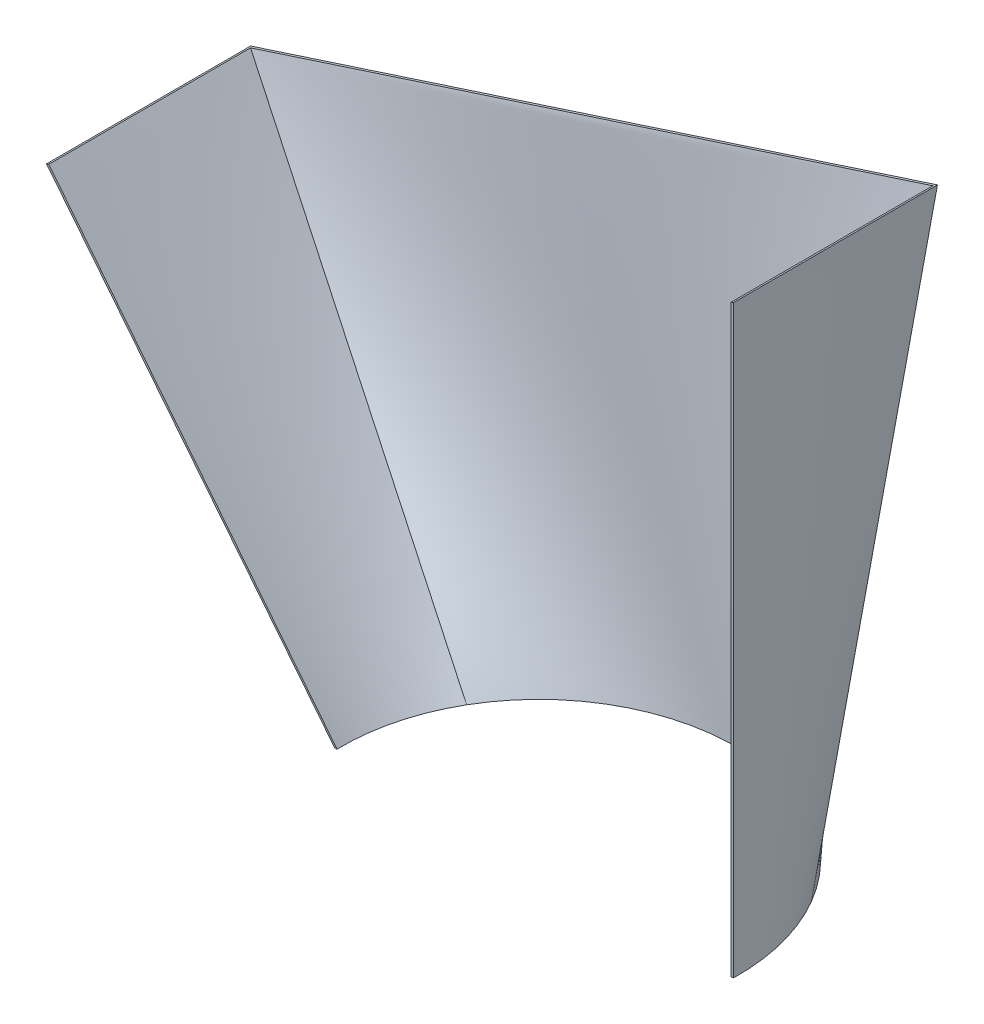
ISO-10303-21;
HEADER;
FILE_DESCRIPTION(('STEP AP214'),'2;1');
FILE_NAME('part.step','',(''),(''),'','','');
FILE_SCHEMA(('AUTOMOTIVE_DESIGN { 1 0 10303 214 1 1 1 1 }'));
ENDSEC;
DATA;
#1=APPLICATION_CONTEXT('core data for automotive mechanical design processes');
#2=APPLICATION_PROTOCOL_DEFINITION('international standard','automotive_design',2000,#1);
#3=PRODUCT_CONTEXT('',#1,'mechanical');
#4=PRODUCT('Part','Part','',(#3));
#5=PRODUCT_RELATED_PRODUCT_CATEGORY('part','',(#4));
#6=PRODUCT_DEFINITION_FORMATION('','',#4);
#7=PRODUCT_DEFINITION_CONTEXT('part definition',#1,'design');
#8=PRODUCT_DEFINITION('design','',#6,#7);
#9=PRODUCT_DEFINITION_SHAPE('','',#8);
#10=(LENGTH_UNIT() NAMED_UNIT(*) SI_UNIT(.MILLI.,.METRE.));
#11=(NAMED_UNIT(*) PLANE_ANGLE_UNIT() SI_UNIT($,.RADIAN.));
#12=(NAMED_UNIT(*) SI_UNIT($,.STERADIAN.) SOLID_ANGLE_UNIT());
#13=UNCERTAINTY_MEASURE_WITH_UNIT(LENGTH_MEASURE(1.E-05),#10,'distance_accuracy_value','');
#14=(GEOMETRIC_REPRESENTATION_CONTEXT(3) GLOBAL_UNCERTAINTY_ASSIGNED_CONTEXT((#13)) GLOBAL_UNIT_ASSIGNED_CONTEXT((#10,
#11,#12)) REPRESENTATION_CONTEXT('',''));
#15=CARTESIAN_POINT('',(0.,0.,0.));
#16=DIRECTION('',(0.,0.,1.));
#17=DIRECTION('',(1.,0.,0.));
#18=AXIS2_PLACEMENT_3D('',#15,#16,#17);
#19=CARTESIAN_POINT('',(0.,0.,0.));
#20=DIRECTION('',(0.,1.,0.));
#21=DIRECTION('',(0.,0.,1.));
#22=AXIS2_PLACEMENT_3D('',#19,#20,#21);
#23=PLANE('',#22);
#24=DIRECTION('',(1.,0.,0.));
#25=VECTOR('',#24,1.);
#26=CARTESIAN_POINT('',(0.,0.,10.));
#27=LINE('',#26,#25);
#28=CARTESIAN_POINT('',(-420.881215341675,0.,10.0000012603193));
#29=VERTEX_POINT('',#28);
#30=CARTESIAN_POINT('',(-415.879763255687,0.,10.0000006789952));
#31=VERTEX_POINT('',#30);
#32=EDGE_CURVE('E112',#29,#31,#27,.T.);
#33=ORIENTED_EDGE('',*,*,#32,.F.);
#34=CARTESIAN_POINT('',(0.,0.,0.));
#35=DIRECTION('',(0.,1.,0.));
#36=DIRECTION('',(0.,0.,1.));
#37=AXIS2_PLACEMENT_3D('',#34,#35,#36);
#38=CIRCLE('',#37,421.);
#39=CARTESIAN_POINT('',(-364.091974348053,0.,-211.371791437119));
#40=VERTEX_POINT('',#39);
#41=EDGE_CURVE('E263',#40,#29,#38,.T.);
#42=ORIENTED_EDGE('',*,*,#41,.F.);
#43=CARTESIAN_POINT('',(364.091974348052,0.,-211.371791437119));
#44=VERTEX_POINT('',#43);
#45=EDGE_CURVE('E268',#44,#40,#38,.T.);
#46=ORIENTED_EDGE('',*,*,#45,.F.);
#47=CARTESIAN_POINT('',(420.881217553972,0.,10.0000013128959));
#48=VERTEX_POINT('',#47);
#49=EDGE_CURVE('E276',#48,#44,#38,.T.);
#50=ORIENTED_EDGE('',*,*,#49,.F.);
#51=CARTESIAN_POINT('',(415.879789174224,0.,10.0000013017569));
#52=VERTEX_POINT('',#51);
#53=EDGE_CURVE('E344',#52,#48,#27,.T.);
#54=ORIENTED_EDGE('',*,*,#53,.F.);
#55=CARTESIAN_POINT('',(0.,0.,0.));
#56=DIRECTION('',(0.,1.,0.));
#57=DIRECTION('',(0.,0.,1.));
#58=AXIS2_PLACEMENT_3D('',#55,#56,#57);
#59=CIRCLE('',#58,416.);
#60=CARTESIAN_POINT('',(360.253087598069,0.,-208.023346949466));
#61=VERTEX_POINT('',#60);
#62=EDGE_CURVE('E239',#52,#61,#59,.T.);
#63=ORIENTED_EDGE('',*,*,#62,.T.);
#64=CARTESIAN_POINT('',(-360.253087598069,0.,-208.023346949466));
#65=VERTEX_POINT('',#64);
#66=EDGE_CURVE('E310',#61,#65,#59,.T.);
#67=ORIENTED_EDGE('',*,*,#66,.T.);
#68=EDGE_CURVE('E294',#65,#31,#59,.T.);
#69=ORIENTED_EDGE('',*,*,#68,.T.);
#70=EDGE_LOOP('',(#33,#42,#46,#50,#54,#63,#67,#69));
#71=FACE_BOUND('',#70,.T.);
#72=ADVANCED_FACE('F87',(#71),#23,.F.);
#73=CARTESIAN_POINT('',(420.999999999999,1235.,-421.));
#74=DIRECTION('',(-0.309016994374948,0.951056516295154,0.));
#75=DIRECTION('',(-0.951056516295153,-0.309016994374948,0.));
#76=AXIS2_PLACEMENT_3D('',#73,#74,#75);
#77=PLANE('',#76);
#78=DIRECTION('',(0.,0.,-1.));
#79=VECTOR('',#78,1.);
#80=CARTESIAN_POINT('',(-1029.36118735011,763.749083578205,421.));
#81=LINE('',#80,#79);
#82=CARTESIAN_POINT('',(-1029.36118735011,763.749083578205,10.));
#83=VERTEX_POINT('',#82);
#84=CARTESIAN_POINT('',(-1029.36118735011,763.749083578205,-421.));
#85=VERTEX_POINT('',#84);
#86=EDGE_CURVE('E97',#83,#85,#81,.T.);
#87=ORIENTED_EDGE('',*,*,#86,.F.);
#88=DIRECTION('',(0.951056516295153,0.309016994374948,0.));
#89=VECTOR('',#88,1.);
#90=CARTESIAN_POINT('',(420.999999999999,1235.,10.));
#91=LINE('',#90,#89);
#92=CARTESIAN_POINT('',(-1024.60590476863,765.294168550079,9.99999999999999));
#93=VERTEX_POINT('',#92);
#94=EDGE_CURVE('E153',#83,#93,#91,.T.);
#95=ORIENTED_EDGE('',*,*,#94,.T.);
#96=DIRECTION('',(0.,0.,1.));
#97=VECTOR('',#96,1.);
#98=CARTESIAN_POINT('',(-1024.60590476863,765.294168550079,-416.));
#99=LINE('',#98,#97);
#100=CARTESIAN_POINT('',(-1024.60590476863,765.294168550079,-416.));
#101=VERTEX_POINT('',#100);
#102=EDGE_CURVE('E164',#101,#93,#99,.T.);
#103=ORIENTED_EDGE('',*,*,#102,.F.);
#104=DIRECTION('',(-0.951056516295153,-0.309016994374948,0.));
#105=VECTOR('',#104,1.);
#106=CARTESIAN_POINT('',(416.244717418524,1233.45491502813,-416.));
#107=LINE('',#106,#105);
#108=CARTESIAN_POINT('',(416.244717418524,1233.45491502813,-416.));
#109=VERTEX_POINT('',#108);
#110=EDGE_CURVE('E174',#109,#101,#107,.T.);
#111=ORIENTED_EDGE('',*,*,#110,.F.);
#112=DIRECTION('',(0.,0.,1.));
#113=VECTOR('',#112,1.);
#114=CARTESIAN_POINT('',(416.244717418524,1233.45491502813,-416.));
#115=LINE('',#114,#113);
#116=CARTESIAN_POINT('',(416.244717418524,1233.45491502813,9.99999999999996));
#117=VERTEX_POINT('',#116);
#118=EDGE_CURVE('E173',#109,#117,#115,.T.);
#119=ORIENTED_EDGE('',*,*,#118,.T.);
#120=CARTESIAN_POINT('',(420.999999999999,1235.,10.));
#121=VERTEX_POINT('',#120);
#122=EDGE_CURVE('E105',#117,#121,#91,.T.);
#123=ORIENTED_EDGE('',*,*,#122,.T.);
#124=DIRECTION('',(0.,0.,-1.));
#125=VECTOR('',#124,1.);
#126=CARTESIAN_POINT('',(420.999999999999,1235.,421.));
#127=LINE('',#126,#125);
#128=CARTESIAN_POINT('',(420.999999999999,1235.,-421.));
#129=VERTEX_POINT('',#128);
#130=EDGE_CURVE('E91',#121,#129,#127,.T.);
#131=ORIENTED_EDGE('',*,*,#130,.T.);
#132=DIRECTION('',(-0.951056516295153,-0.309016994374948,0.));
#133=VECTOR('',#132,1.);
#134=CARTESIAN_POINT('',(420.999999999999,1235.,-421.));
#135=LINE('',#134,#133);
#136=EDGE_CURVE('E251',#129,#85,#135,.T.);
#137=ORIENTED_EDGE('',*,*,#136,.T.);
#138=EDGE_LOOP('',(#87,#95,#103,#111,#119,#123,#131,#137));
#139=FACE_BOUND('',#138,.T.);
#140=ADVANCED_FACE('F162',(#139),#77,.T.);
#141=CARTESIAN_POINT('',(-1029.36118735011,763.749083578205,421.));
#142=CARTESIAN_POINT('',(-364.091974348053,0.,211.371791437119));
#143=CARTESIAN_POINT('',(-1029.36118735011,763.749083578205,385.916666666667));
#144=CARTESIAN_POINT('',(-372.935607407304,0.,196.138463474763));
#145=CARTESIAN_POINT('',(-1029.36118735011,763.749083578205,350.833333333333));
#146=CARTESIAN_POINT('',(-380.970778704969,0.,180.088104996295));
#147=CARTESIAN_POINT('',(-1029.36118735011,763.749083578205,298.208333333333));
#148=CARTESIAN_POINT('',(-391.535403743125,0.,154.994814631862));
#149=CARTESIAN_POINT('',(-1029.36118735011,763.749083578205,280.666666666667));
#150=CARTESIAN_POINT('',(-394.809273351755,0.,146.461634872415));
#151=CARTESIAN_POINT('',(-1029.36118735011,763.749083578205,245.583333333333));
#152=CARTESIAN_POINT('',(-400.821587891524,0.,129.10239151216));
#153=CARTESIAN_POINT('',(-1029.36118735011,763.749083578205,228.041666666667));
#154=CARTESIAN_POINT('',(-403.559995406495,0.,120.276351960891));
#155=CARTESIAN_POINT('',(-1029.36118735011,763.749083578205,192.958333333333));
#156=CARTESIAN_POINT('',(-408.466640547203,0.,102.382001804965));
#157=CARTESIAN_POINT('',(-1029.36118735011,763.749083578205,175.416666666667));
#158=CARTESIAN_POINT('',(-410.634845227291,0.,93.3137230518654));
#159=CARTESIAN_POINT('',(-1029.36118735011,763.749083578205,140.333333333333));
#160=CARTESIAN_POINT('',(-414.372817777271,0.,74.9906321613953));
#161=CARTESIAN_POINT('',(-1029.36118735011,763.749083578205,122.791666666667));
#162=CARTESIAN_POINT('',(-415.942559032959,0.,65.7358586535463));
#163=CARTESIAN_POINT('',(-1029.36118735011,763.749083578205,87.7083333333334));
#164=CARTESIAN_POINT('',(-418.462716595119,0.,47.0995790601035));
#165=CARTESIAN_POINT('',(-1029.36118735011,763.749083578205,70.1666666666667));
#166=CARTESIAN_POINT('',(-419.413114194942,0.,37.7181168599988));
#167=CARTESIAN_POINT('',(-1029.36118735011,763.749083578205,35.0833333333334));
#168=CARTESIAN_POINT('',(-420.681760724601,0.,18.8910796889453));
#169=CARTESIAN_POINT('',(-1029.36118735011,763.749083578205,17.5416666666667));
#170=CARTESIAN_POINT('',(-421.,0.,9.4455519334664));
#171=CARTESIAN_POINT('',(-1029.36118735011,763.749083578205,-17.5416666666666));
#172=CARTESIAN_POINT('',(-421.,0.,-9.44555193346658));
#173=CARTESIAN_POINT('',(-1029.36118735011,763.749083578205,-35.0833333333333));
#174=CARTESIAN_POINT('',(-420.681760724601,0.,-18.8910796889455));
#175=CARTESIAN_POINT('',(-1029.36118735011,763.749083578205,-70.1666666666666));
#176=CARTESIAN_POINT('',(-419.413114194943,0.,-37.718116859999));
#177=CARTESIAN_POINT('',(-1029.36118735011,763.749083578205,-87.7083333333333));
#178=CARTESIAN_POINT('',(-418.462716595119,0.,-47.0995790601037));
#179=CARTESIAN_POINT('',(-1029.36118735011,763.749083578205,-122.791666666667));
#180=CARTESIAN_POINT('',(-415.942559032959,0.,-65.7358586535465));
#181=CARTESIAN_POINT('',(-1029.36118735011,763.749083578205,-140.333333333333));
#182=CARTESIAN_POINT('',(-414.372817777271,0.,-74.9906321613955));
#183=CARTESIAN_POINT('',(-1029.36118735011,763.749083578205,-175.416666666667));
#184=CARTESIAN_POINT('',(-410.634845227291,0.,-93.3137230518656));
#185=CARTESIAN_POINT('',(-1029.36118735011,763.749083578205,-192.958333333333));
#186=CARTESIAN_POINT('',(-408.466640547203,0.,-102.382001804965));
#187=CARTESIAN_POINT('',(-1029.36118735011,763.749083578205,-228.041666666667));
#188=CARTESIAN_POINT('',(-403.559995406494,0.,-120.276351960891));
#189=CARTESIAN_POINT('',(-1029.36118735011,763.749083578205,-245.583333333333));
#190=CARTESIAN_POINT('',(-400.821587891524,0.,-129.10239151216));
#191=CARTESIAN_POINT('',(-1029.36118735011,763.749083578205,-280.666666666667));
#192=CARTESIAN_POINT('',(-394.809273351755,0.,-146.461634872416));
#193=CARTESIAN_POINT('',(-1029.36118735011,763.749083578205,-298.208333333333));
#194=CARTESIAN_POINT('',(-391.535403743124,0.,-154.994814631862));
#195=CARTESIAN_POINT('',(-1029.36118735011,763.749083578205,-350.833333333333));
#196=CARTESIAN_POINT('',(-380.970778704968,0.,-180.088104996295));
#197=CARTESIAN_POINT('',(-1029.36118735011,763.749083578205,-385.916666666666));
#198=CARTESIAN_POINT('',(-372.935607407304,0.,-196.138463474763));
#199=CARTESIAN_POINT('',(-1029.36118735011,763.749083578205,-421.));
#200=CARTESIAN_POINT('',(-364.091974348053,0.,-211.371791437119));
#201=B_SPLINE_SURFACE_WITH_KNOTS('',3,1,((#141,#142),(#143,#144),(#145,#146),(#147,#148),(#149,
#150),(#151,#152),(#153,#154),(#155,#156),(#157,#158),(#159,#160),(#161,#162),(#163,#164),(#165,
#166),(#167,#168),(#169,#170),(#171,#172),(#173,#174),(#175,#176),(#177,#178),(#179,#180),(#181,
#182),(#183,#184),(#185,#186),(#187,#188),(#189,#190),(#191,#192),(#193,#194),(#195,#196),(#197,
#198),(#199,#200)),.UNSPECIFIED.,.F.,.F.,.F.,(4,2,2,2,2,2,2,2,2,2,2,2,2,2,4),(2,2),(0.,0.125,
0.1875,0.25,0.3125,0.375,0.4375,0.5,0.5625,0.625,0.6875,0.75,0.8125,0.875,1.),(0.,1.),.UNSPECIFIED.);
#202=CARTESIAN_POINT('',(-420.881162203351,0.,9.99999999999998));
#203=CARTESIAN_POINT('',(-434.863254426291,17.5441170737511,9.99999999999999));
#204=CARTESIAN_POINT('',(-448.844911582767,35.0885808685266,10.));
#205=CARTESIAN_POINT('',(-476.807514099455,70.1780756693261,10.));
#206=CARTESIAN_POINT('',(-490.788459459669,87.7231066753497,10.));
#207=CARTESIAN_POINT('',(-532.730465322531,140.358861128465,10.));
#208=CARTESIAN_POINT('',(-560.690695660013,175.450246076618,10.));
#209=CARTESIAN_POINT('',(-616.609719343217,245.634160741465,10.));
#210=CARTESIAN_POINT('',(-644.568512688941,280.726690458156,10.));
#211=CARTESIAN_POINT('',(-700.485121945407,350.912528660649,10.));
#212=CARTESIAN_POINT('',(-728.442937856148,386.00583714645,10.));
#213=CARTESIAN_POINT('',(-801.895190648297,478.206647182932,10.));
#214=CARTESIAN_POINT('',(-847.389073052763,535.314590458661,10.));
#215=CARTESIAN_POINT('',(-915.629122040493,620.977122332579,10.));
#216=CARTESIAN_POINT('',(-938.375675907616,649.531402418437,10.));
#217=CARTESIAN_POINT('',(-983.868575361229,706.640128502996,10.));
#218=CARTESIAN_POINT('',(-1006.61492094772,735.194574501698,10.));
#219=CARTESIAN_POINT('',(-1029.36118735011,763.749083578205,10.));
#220=B_SPLINE_CURVE_WITH_KNOTS('',3,(#202,#203,#204,#205,#206,#207,#208,#209,#210,#211,#212,
#213,#214,#215,#216,#217,#218,#219),.UNSPECIFIED.,.F.,.F.,(4,2,2,2,2,2,2,2,4),(0.,
67.3027081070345,134.605416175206,269.210832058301,403.816247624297,538.421663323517,
757.462971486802,866.983625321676,976.50427914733),.UNSPECIFIED.);
#221=EDGE_CURVE('E350',#29,#83,#220,.T.);
#222=DIRECTION('',(0.643188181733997,-0.738399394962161,0.202670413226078));
#223=VECTOR('',#222,1.);
#224=CARTESIAN_POINT('',(-696.726580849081,381.874541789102,-316.185895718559));
#225=LINE('',#224,#223);
#226=EDGE_CURVE('E407',#85,#40,#225,.T.);
#227=ORIENTED_EDGE('',*,*,#41,.T.);
#228=ORIENTED_EDGE('',*,*,#221,.T.);
#229=ORIENTED_EDGE('',*,*,#86,.T.);
#230=ORIENTED_EDGE('',*,*,#226,.T.);
#231=EDGE_LOOP('',(#227,#228,#229,#230));
#232=FACE_BOUND('',#231,.T.);
#233=ADVANCED_FACE('F371',(#232),#201,.T.);
#234=CARTESIAN_POINT('',(420.999999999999,1235.,-421.));
#235=CARTESIAN_POINT('',(364.091974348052,0.,-211.371791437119));
#236=CARTESIAN_POINT('',(420.999999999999,1235.,-385.916666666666));
#237=CARTESIAN_POINT('',(372.935607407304,0.,-196.138463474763));
#238=CARTESIAN_POINT('',(420.999999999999,1235.,-350.833333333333));
#239=CARTESIAN_POINT('',(380.970778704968,0.,-180.088104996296));
#240=CARTESIAN_POINT('',(420.999999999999,1235.,-298.208333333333));
#241=CARTESIAN_POINT('',(391.535403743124,0.,-154.994814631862));
#242=CARTESIAN_POINT('',(420.999999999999,1235.,-280.666666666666));
#243=CARTESIAN_POINT('',(394.809273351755,0.,-146.461634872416));
#244=CARTESIAN_POINT('',(420.999999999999,1235.,-245.583333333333));
#245=CARTESIAN_POINT('',(400.821587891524,0.,-129.10239151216));
#246=CARTESIAN_POINT('',(420.999999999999,1235.,-228.041666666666));
#247=CARTESIAN_POINT('',(403.559995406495,0.,-120.276351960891));
#248=CARTESIAN_POINT('',(420.999999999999,1235.,-192.958333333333));
#249=CARTESIAN_POINT('',(408.466640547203,0.,-102.382001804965));
#250=CARTESIAN_POINT('',(420.999999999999,1235.,-175.416666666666));
#251=CARTESIAN_POINT('',(410.634845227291,0.,-93.3137230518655));
#252=CARTESIAN_POINT('',(420.999999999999,1235.,-140.333333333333));
#253=CARTESIAN_POINT('',(414.372817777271,0.,-74.9906321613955));
#254=CARTESIAN_POINT('',(420.999999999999,1235.,-122.791666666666));
#255=CARTESIAN_POINT('',(415.942559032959,0.,-65.7358586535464));
#256=CARTESIAN_POINT('',(420.999999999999,1235.,-87.7083333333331));
#257=CARTESIAN_POINT('',(418.462716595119,0.,-47.0995790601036));
#258=CARTESIAN_POINT('',(420.999999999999,1235.,-70.1666666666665));
#259=CARTESIAN_POINT('',(419.413114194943,0.,-37.7181168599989));
#260=CARTESIAN_POINT('',(420.999999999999,1235.,-35.0833333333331));
#261=CARTESIAN_POINT('',(420.681760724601,0.,-18.8910796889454));
#262=CARTESIAN_POINT('',(420.999999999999,1235.,-17.5416666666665));
#263=CARTESIAN_POINT('',(421.,0.,-9.44555193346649));
#264=CARTESIAN_POINT('',(420.999999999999,1235.,17.5416666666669));
#265=CARTESIAN_POINT('',(421.,0.,9.44555193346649));
#266=CARTESIAN_POINT('',(420.999999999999,1235.,35.0833333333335));
#267=CARTESIAN_POINT('',(420.681760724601,0.,18.8910796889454));
#268=CARTESIAN_POINT('',(420.999999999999,1235.,70.1666666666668));
#269=CARTESIAN_POINT('',(419.413114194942,0.,37.7181168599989));
#270=CARTESIAN_POINT('',(420.999999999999,1235.,87.7083333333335));
#271=CARTESIAN_POINT('',(418.462716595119,0.,47.0995790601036));
#272=CARTESIAN_POINT('',(420.999999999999,1235.,122.791666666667));
#273=CARTESIAN_POINT('',(415.942559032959,0.,65.7358586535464));
#274=CARTESIAN_POINT('',(420.999999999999,1235.,140.333333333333));
#275=CARTESIAN_POINT('',(414.372817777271,0.,74.9906321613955));
#276=CARTESIAN_POINT('',(420.999999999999,1235.,175.416666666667));
#277=CARTESIAN_POINT('',(410.634845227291,0.,93.3137230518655));
#278=CARTESIAN_POINT('',(420.999999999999,1235.,192.958333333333));
#279=CARTESIAN_POINT('',(408.466640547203,0.,102.382001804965));
#280=CARTESIAN_POINT('',(420.999999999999,1235.,228.041666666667));
#281=CARTESIAN_POINT('',(403.559995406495,0.,120.276351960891));
#282=CARTESIAN_POINT('',(420.999999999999,1235.,245.583333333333));
#283=CARTESIAN_POINT('',(400.821587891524,0.,129.10239151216));
#284=CARTESIAN_POINT('',(420.999999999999,1235.,280.666666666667));
#285=CARTESIAN_POINT('',(394.809273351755,0.,146.461634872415));
#286=CARTESIAN_POINT('',(420.999999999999,1235.,298.208333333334));
#287=CARTESIAN_POINT('',(391.535403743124,0.,154.994814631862));
#288=CARTESIAN_POINT('',(420.999999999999,1235.,350.833333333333));
#289=CARTESIAN_POINT('',(380.970778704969,0.,180.088104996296));
#290=CARTESIAN_POINT('',(420.999999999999,1235.,385.916666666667));
#291=CARTESIAN_POINT('',(372.935607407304,0.,196.138463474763));
#292=CARTESIAN_POINT('',(420.999999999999,1235.,421.));
#293=CARTESIAN_POINT('',(364.091974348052,0.,211.371791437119));
#294=B_SPLINE_SURFACE_WITH_KNOTS('',3,1,((#234,#235),(#236,#237),(#238,#239),(#240,#241),(#242,
#243),(#244,#245),(#246,#247),(#248,#249),(#250,#251),(#252,#253),(#254,#255),(#256,#257),(#258,
#259),(#260,#261),(#262,#263),(#264,#265),(#266,#267),(#268,#269),(#270,#271),(#272,#273),(#274,
#275),(#276,#277),(#278,#279),(#280,#281),(#282,#283),(#284,#285),(#286,#287),(#288,#289),(#290,
#291),(#292,#293)),.UNSPECIFIED.,.F.,.F.,.F.,(4,2,2,2,2,2,2,2,2,2,2,2,2,2,4),(2,2),(0.,0.125,
0.1875,0.25,0.3125,0.375,0.4375,0.5,0.5625,0.625,0.6875,0.75,0.8125,0.875,1.),(0.,1.),.UNSPECIFIED.);
#295=CARTESIAN_POINT('',(420.999999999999,1235.,10.));
#296=CARTESIAN_POINT('',(420.998069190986,1166.6784234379,10.));
#297=CARTESIAN_POINT('',(420.995892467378,1098.356846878,10.));
#298=CARTESIAN_POINT('',(420.990693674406,961.713693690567,9.99999999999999));
#299=CARTESIAN_POINT('',(420.987671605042,893.392117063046,9.99999999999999));
#300=CARTESIAN_POINT('',(420.980405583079,756.314661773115,9.99999999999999));
#301=CARTESIAN_POINT('',(420.97615398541,687.558783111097,10.));
#302=CARTESIAN_POINT('',(420.965811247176,550.04702597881,9.99999999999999));
#303=CARTESIAN_POINT('',(420.959720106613,481.291147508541,9.99999999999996));
#304=CARTESIAN_POINT('',(420.948394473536,378.15732980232,9.99999999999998));
#305=CARTESIAN_POINT('',(420.944254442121,343.779390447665,9.99999999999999));
#306=CARTESIAN_POINT('',(420.935029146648,275.023511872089,10.));
#307=CARTESIAN_POINT('',(420.929943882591,240.645572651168,10.));
#308=CARTESIAN_POINT('',(420.918561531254,171.889694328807,10.));
#309=CARTESIAN_POINT('',(420.91226444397,137.511755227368,10.));
#310=CARTESIAN_POINT('',(420.898040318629,68.7558773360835,10.));
#311=CARTESIAN_POINT('',(420.890113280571,34.3779385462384,10.));
#312=CARTESIAN_POINT('',(420.881162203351,0.,10.));
#313=B_SPLINE_CURVE_WITH_KNOTS('',3,(#295,#296,#297,#298,#299,#300,#301,#302,#303,#304,#305,
#306,#307,#308,#309,#310,#311,#312),.UNSPECIFIED.,.F.,.F.,(4,2,2,2,2,2,2,2,4),(0.,
204.964729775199,409.929459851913,616.197096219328,822.464732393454,925.598551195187,
1028.73236997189,1131.86618897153,1235.00000805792),.UNSPECIFIED.);
#314=EDGE_CURVE('E295',#121,#48,#313,.T.);
#315=DIRECTION('',(-0.0453827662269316,-0.984882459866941,0.16717339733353));
#316=VECTOR('',#315,1.);
#317=CARTESIAN_POINT('',(392.545987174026,617.5,-316.18589571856));
#318=LINE('',#317,#316);
#319=EDGE_CURVE('E492',#129,#44,#318,.T.);
#320=ORIENTED_EDGE('',*,*,#130,.F.);
#321=ORIENTED_EDGE('',*,*,#314,.T.);
#322=ORIENTED_EDGE('',*,*,#49,.T.);
#323=ORIENTED_EDGE('',*,*,#319,.F.);
#324=EDGE_LOOP('',(#320,#321,#322,#323));
#325=FACE_BOUND('',#324,.T.);
#326=ADVANCED_FACE('F366',(#325),#294,.T.);
#327=CARTESIAN_POINT('',(416.244717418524,1233.45491502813,-416.));
#328=CARTESIAN_POINT('',(360.253087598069,0.,-208.023346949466));
#329=CARTESIAN_POINT('',(416.244717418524,1233.45491502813,-381.333333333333));
#330=CARTESIAN_POINT('',(368.921699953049,0.,-193.011116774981));
#331=CARTESIAN_POINT('',(416.244717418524,1233.45491502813,-346.666666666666));
#332=CARTESIAN_POINT('',(376.795315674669,0.,-177.201090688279));
#333=CARTESIAN_POINT('',(416.244717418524,1233.45491502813,-277.333333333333));
#334=CARTESIAN_POINT('',(390.595450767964,0.,-144.257167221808));
#335=CARTESIAN_POINT('',(416.244717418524,1233.45491502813,-242.666666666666));
#336=CARTESIAN_POINT('',(396.52074717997,0.,-127.123764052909));
#337=CARTESIAN_POINT('',(416.244717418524,1233.45491502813,-190.666666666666));
#338=CARTESIAN_POINT('',(403.728412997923,0.,-100.710759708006));
#339=CARTESIAN_POINT('',(416.244717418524,1233.45491502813,-173.333333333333));
#340=CARTESIAN_POINT('',(405.851558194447,0.,-91.7883526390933));
#341=CARTESIAN_POINT('',(416.244717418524,1233.45491502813,-138.666666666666));
#342=CARTESIAN_POINT('',(409.511657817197,0.,-73.7617182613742));
#343=CARTESIAN_POINT('',(416.244717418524,1233.45491502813,-121.333333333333));
#344=CARTESIAN_POINT('',(411.048586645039,0.,-64.6575283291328));
#345=CARTESIAN_POINT('',(416.244717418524,1233.45491502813,-86.6666666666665));
#346=CARTESIAN_POINT('',(413.515987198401,0.,-46.3256395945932));
#347=CARTESIAN_POINT('',(416.244717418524,1233.45491502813,-69.3333333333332));
#348=CARTESIAN_POINT('',(414.446440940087,0.,-37.0979832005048));
#349=CARTESIAN_POINT('',(416.244717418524,1233.45491502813,-34.6666666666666));
#350=CARTESIAN_POINT('',(415.688451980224,0.,-18.5801952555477));
#351=CARTESIAN_POINT('',(416.244717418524,1233.45491502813,-17.3333333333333));
#352=CARTESIAN_POINT('',(416.,0.,-9.29010929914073));
#353=CARTESIAN_POINT('',(416.244717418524,1233.45491502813,17.3333333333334));
#354=CARTESIAN_POINT('',(416.,0.,9.29010929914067));
#355=CARTESIAN_POINT('',(416.244717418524,1233.45491502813,34.6666666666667));
#356=CARTESIAN_POINT('',(415.688451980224,0.,18.5801952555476));
#357=CARTESIAN_POINT('',(416.244717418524,1233.45491502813,69.3333333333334));
#358=CARTESIAN_POINT('',(414.446440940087,0.,37.0979832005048));
#359=CARTESIAN_POINT('',(416.244717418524,1233.45491502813,86.6666666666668));
#360=CARTESIAN_POINT('',(413.515987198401,0.,46.3256395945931));
#361=CARTESIAN_POINT('',(416.244717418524,1233.45491502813,121.333333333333));
#362=CARTESIAN_POINT('',(411.048586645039,0.,64.6575283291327));
#363=CARTESIAN_POINT('',(416.244717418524,1233.45491502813,138.666666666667));
#364=CARTESIAN_POINT('',(409.511657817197,0.,73.7617182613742));
#365=CARTESIAN_POINT('',(416.244717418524,1233.45491502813,173.333333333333));
#366=CARTESIAN_POINT('',(405.851558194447,0.,91.7883526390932));
#367=CARTESIAN_POINT('',(416.244717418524,1233.45491502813,190.666666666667));
#368=CARTESIAN_POINT('',(403.728412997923,0.,100.710759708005));
#369=CARTESIAN_POINT('',(416.244717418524,1233.45491502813,242.666666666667));
#370=CARTESIAN_POINT('',(396.52074717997,0.,127.123764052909));
#371=CARTESIAN_POINT('',(416.244717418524,1233.45491502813,277.333333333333));
#372=CARTESIAN_POINT('',(390.595450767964,0.,144.257167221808));
#373=CARTESIAN_POINT('',(416.244717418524,1233.45491502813,346.666666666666));
#374=CARTESIAN_POINT('',(376.795315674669,0.,177.201090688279));
#375=CARTESIAN_POINT('',(416.244717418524,1233.45491502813,381.333333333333));
#376=CARTESIAN_POINT('',(368.921699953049,0.,193.011116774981));
#377=CARTESIAN_POINT('',(416.244717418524,1233.45491502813,416.));
#378=CARTESIAN_POINT('',(360.253087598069,0.,208.023346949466));
#379=B_SPLINE_SURFACE_WITH_KNOTS('',3,1,((#327,#328),(#329,#330),(#331,#332),(#333,#334),(#335,
#336),(#337,#338),(#339,#340),(#341,#342),(#343,#344),(#345,#346),(#347,#348),(#349,#350),(#351,
#352),(#353,#354),(#355,#356),(#357,#358),(#359,#360),(#361,#362),(#363,#364),(#365,#366),(#367,
#368),(#369,#370),(#371,#372),(#373,#374),(#375,#376),(#377,#378)),.UNSPECIFIED.,.F.,.F.,.F.,(4,
2,2,2,2,2,2,2,2,2,2,2,4),(2,2),(0.,0.125,0.25,0.3125,0.375,0.4375,0.5,0.5625,0.625,0.6875,0.75,
0.875,1.),(0.,1.),.UNSPECIFIED.);
#380=CARTESIAN_POINT('',(416.244717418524,1233.45491502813,10.));
#381=CARTESIAN_POINT('',(416.229273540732,1165.35274097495,10.));
#382=CARTESIAN_POINT('',(416.213583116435,1097.25056697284,10.));
#383=CARTESIAN_POINT('',(416.18135228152,961.046219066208,10.));
#384=CARTESIAN_POINT('',(416.164811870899,892.944045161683,10.));
#385=CARTESIAN_POINT('',(416.130364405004,756.105047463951,10.));
#386=CARTESIAN_POINT('',(416.112446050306,687.368223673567,10.));
#387=CARTESIAN_POINT('',(416.074741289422,549.894576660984,10.));
#388=CARTESIAN_POINT('',(416.054954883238,481.157753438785,10.));
#389=CARTESIAN_POINT('',(416.023044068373,378.052519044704,10.));
#390=CARTESIAN_POINT('',(416.012035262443,343.684107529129,10.));
#391=CARTESIAN_POINT('',(415.989051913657,274.947284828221,10.));
#392=CARTESIAN_POINT('',(415.977077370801,240.57887364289,10.));
#393=CARTESIAN_POINT('',(415.951887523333,171.842051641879,10.));
#394=CARTESIAN_POINT('',(415.938672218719,137.473640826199,10.));
#395=CARTESIAN_POINT('',(415.910567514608,68.7368198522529,10.));
#396=CARTESIAN_POINT('',(415.895678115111,34.3684096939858,9.99999999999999));
#397=CARTESIAN_POINT('',(415.879735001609,0.,9.99999999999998));
#398=B_SPLINE_CURVE_WITH_KNOTS('',3,(#380,#381,#382,#383,#384,#385,#386,#387,#388,#389,#390,
#391,#392,#393,#394,#395,#396,#397),.UNSPECIFIED.,.F.,.F.,(4,2,2,2,2,2,2,2,4),(0.,
204.306527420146,408.613055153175,614.823533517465,821.034011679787,924.139251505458,
1027.24449130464,1130.34973133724,1233.45497146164),.UNSPECIFIED.);
#399=EDGE_CURVE('E341',#117,#52,#398,.T.);
#400=DIRECTION('',(-0.0447175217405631,-0.985094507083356,0.166099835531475));
#401=VECTOR('',#400,1.);
#402=CARTESIAN_POINT('',(388.248902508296,616.727457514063,-312.011673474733));
#403=LINE('',#402,#401);
#404=EDGE_CURVE('E306',#109,#61,#403,.T.);
#405=ORIENTED_EDGE('',*,*,#399,.F.);
#406=ORIENTED_EDGE('',*,*,#118,.F.);
#407=ORIENTED_EDGE('',*,*,#404,.T.);
#408=ORIENTED_EDGE('',*,*,#62,.F.);
#409=EDGE_LOOP('',(#405,#406,#407,#408));
#410=FACE_BOUND('',#409,.T.);
#411=ADVANCED_FACE('F197',(#410),#379,.F.);
#412=CARTESIAN_POINT('',(-1024.60590476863,765.294168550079,416.));
#413=CARTESIAN_POINT('',(-360.253087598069,0.,208.023346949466));
#414=CARTESIAN_POINT('',(-1024.60590476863,765.294168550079,381.333333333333));
#415=CARTESIAN_POINT('',(-368.921699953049,0.,193.011116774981));
#416=CARTESIAN_POINT('',(-1024.60590476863,765.294168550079,346.666666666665));
#417=CARTESIAN_POINT('',(-376.795315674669,0.,177.201090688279));
#418=CARTESIAN_POINT('',(-1024.60590476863,765.294168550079,277.333333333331));
#419=CARTESIAN_POINT('',(-390.595450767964,0.,144.257167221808));
#420=CARTESIAN_POINT('',(-1024.60590476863,765.294168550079,242.666666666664));
#421=CARTESIAN_POINT('',(-396.52074717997,0.,127.123764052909));
#422=CARTESIAN_POINT('',(-1024.60590476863,765.294168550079,190.666666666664));
#423=CARTESIAN_POINT('',(-403.728412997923,0.,100.710759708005));
#424=CARTESIAN_POINT('',(-1024.60590476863,765.294168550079,173.333333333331));
#425=CARTESIAN_POINT('',(-405.851558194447,0.,91.7883526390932));
#426=CARTESIAN_POINT('',(-1024.60590476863,765.294168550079,138.666666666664));
#427=CARTESIAN_POINT('',(-409.511657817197,0.,73.7617182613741));
#428=CARTESIAN_POINT('',(-1024.60590476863,765.294168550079,121.33333333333));
#429=CARTESIAN_POINT('',(-411.048586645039,0.,64.6575283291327));
#430=CARTESIAN_POINT('',(-1024.60590476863,765.294168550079,86.6666666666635));
#431=CARTESIAN_POINT('',(-413.515987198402,0.,46.325639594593));
#432=CARTESIAN_POINT('',(-1024.60590476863,765.294168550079,69.3333333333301));
#433=CARTESIAN_POINT('',(-414.446440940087,0.,37.0979832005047));
#434=CARTESIAN_POINT('',(-1024.60590476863,765.294168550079,34.6666666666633));
#435=CARTESIAN_POINT('',(-415.688451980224,0.,18.5801952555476));
#436=CARTESIAN_POINT('',(-1024.60590476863,765.294168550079,17.3333333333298));
#437=CARTESIAN_POINT('',(-416.,0.,9.29010929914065));
#438=CARTESIAN_POINT('',(-1024.60590476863,765.294168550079,-17.3333333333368));
#439=CARTESIAN_POINT('',(-416.,0.,-9.29010929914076));
#440=CARTESIAN_POINT('',(-1024.60590476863,765.294168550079,-34.6666666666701));
#441=CARTESIAN_POINT('',(-415.688451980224,0.,-18.5801952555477));
#442=CARTESIAN_POINT('',(-1024.60590476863,765.294168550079,-69.3333333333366));
#443=CARTESIAN_POINT('',(-414.446440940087,0.,-37.0979832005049));
#444=CARTESIAN_POINT('',(-1024.60590476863,765.294168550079,-86.6666666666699));
#445=CARTESIAN_POINT('',(-413.515987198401,0.,-46.3256395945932));
#446=CARTESIAN_POINT('',(-1024.60590476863,765.294168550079,-121.333333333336));
#447=CARTESIAN_POINT('',(-411.048586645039,0.,-64.6575283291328));
#448=CARTESIAN_POINT('',(-1024.60590476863,765.294168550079,-138.66666666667));
#449=CARTESIAN_POINT('',(-409.511657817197,0.,-73.7617182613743));
#450=CARTESIAN_POINT('',(-1024.60590476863,765.294168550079,-173.333333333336));
#451=CARTESIAN_POINT('',(-405.851558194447,0.,-91.7883526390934));
#452=CARTESIAN_POINT('',(-1024.60590476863,765.294168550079,-190.666666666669));
#453=CARTESIAN_POINT('',(-403.728412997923,0.,-100.710759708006));
#454=CARTESIAN_POINT('',(-1024.60590476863,765.294168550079,-242.666666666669));
#455=CARTESIAN_POINT('',(-396.52074717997,0.,-127.123764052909));
#456=CARTESIAN_POINT('',(-1024.60590476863,765.294168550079,-277.333333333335));
#457=CARTESIAN_POINT('',(-390.595450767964,0.,-144.257167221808));
#458=CARTESIAN_POINT('',(-1024.60590476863,765.294168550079,-346.666666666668));
#459=CARTESIAN_POINT('',(-376.795315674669,0.,-177.201090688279));
#460=CARTESIAN_POINT('',(-1024.60590476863,765.294168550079,-381.333333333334));
#461=CARTESIAN_POINT('',(-368.921699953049,0.,-193.011116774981));
#462=CARTESIAN_POINT('',(-1024.60590476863,765.294168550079,-416.));
#463=CARTESIAN_POINT('',(-360.253087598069,0.,-208.023346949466));
#464=B_SPLINE_SURFACE_WITH_KNOTS('',3,1,((#412,#413),(#414,#415),(#416,#417),(#418,#419),(#420,
#421),(#422,#423),(#424,#425),(#426,#427),(#428,#429),(#430,#431),(#432,#433),(#434,#435),(#436,
#437),(#438,#439),(#440,#441),(#442,#443),(#444,#445),(#446,#447),(#448,#449),(#450,#451),(#452,
#453),(#454,#455),(#456,#457),(#458,#459),(#460,#461),(#462,#463)),.UNSPECIFIED.,.F.,.F.,.F.,(4,
2,2,2,2,2,2,2,2,2,2,2,4),(2,2),(0.,0.125,0.25,0.3125,0.375,0.4375,0.5,0.5625,0.625,0.6875,0.75,
0.875,1.),(0.,1.),.UNSPECIFIED.);
#465=CARTESIAN_POINT('',(-415.879735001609,0.,9.99999999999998));
#466=CARTESIAN_POINT('',(-429.673633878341,17.3358554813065,9.99999999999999));
#467=CARTESIAN_POINT('',(-443.467097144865,34.6720575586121,10.));
#468=CARTESIAN_POINT('',(-471.053310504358,69.3450291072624,10.));
#469=CARTESIAN_POINT('',(-484.846060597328,86.6817985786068,10.));
#470=CARTESIAN_POINT('',(-526.22347815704,138.692769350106,10.));
#471=CARTESIAN_POINT('',(-553.807312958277,173.367633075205,9.99999999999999));
#472=CARTESIAN_POINT('',(-608.973538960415,242.718508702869,9.99999999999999));
#473=CARTESIAN_POINT('',(-636.555930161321,277.394520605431,10.));
#474=CARTESIAN_POINT('',(-691.719729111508,346.747326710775,10.));
#475=CARTESIAN_POINT('',(-719.301136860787,381.424120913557,10.));
#476=CARTESIAN_POINT('',(-793.170883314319,474.29890637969,10.));
#477=CARTESIAN_POINT('',(-839.458607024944,532.497386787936,10.));
#478=CARTESIAN_POINT('',(-908.889375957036,619.795756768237,10.));
#479=CARTESIAN_POINT('',(-932.032829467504,648.895321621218,10.));
#480=CARTESIAN_POINT('',(-978.319517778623,707.094625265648,10.));
#481=CARTESIAN_POINT('',(-1001.46275257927,736.194364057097,10.));
#482=CARTESIAN_POINT('',(-1024.60590476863,765.294168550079,9.99999999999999));
#483=B_SPLINE_CURVE_WITH_KNOTS('',3,(#465,#466,#467,#468,#469,#470,#471,#472,#473,#474,#475,
#476,#477,#478,#479,#480,#481,#482),.UNSPECIFIED.,.F.,.F.,(4,2,2,2,2,2,2,2,4),(0.,
66.4622583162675,132.92451659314,265.849032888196,398.773548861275,531.698064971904,
754.782238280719,866.324324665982,977.866411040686),.UNSPECIFIED.);
#484=EDGE_CURVE('E12',#31,#93,#483,.T.);
#485=DIRECTION('',(-0.642165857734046,0.739736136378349,-0.201030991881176));
#486=VECTOR('',#485,1.);
#487=CARTESIAN_POINT('',(-692.429496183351,382.64708427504,-312.011673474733));
#488=LINE('',#487,#486);
#489=EDGE_CURVE('E171',#65,#101,#488,.T.);
#490=ORIENTED_EDGE('',*,*,#484,.F.);
#491=ORIENTED_EDGE('',*,*,#68,.F.);
#492=ORIENTED_EDGE('',*,*,#489,.T.);
#493=ORIENTED_EDGE('',*,*,#102,.T.);
#494=EDGE_LOOP('',(#490,#491,#492,#493));
#495=FACE_BOUND('',#494,.T.);
#496=ADVANCED_FACE('F170',(#495),#464,.F.);
#497=CARTESIAN_POINT('',(-1029.36118735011,763.749083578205,-421.));
#498=CARTESIAN_POINT('',(-364.091974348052,0.,-211.371791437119));
#499=CARTESIAN_POINT('',(-999.145329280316,773.566811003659,-421.));
#500=CARTESIAN_POINT('',(-356.475310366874,0.,-224.49164157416));
#501=CARTESIAN_POINT('',(-968.929471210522,783.384538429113,-421.));
#502=CARTESIAN_POINT('',(-347.910124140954,0.,-237.611228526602));
#503=CARTESIAN_POINT('',(-908.497755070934,803.019993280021,-421.));
#504=CARTESIAN_POINT('',(-328.733732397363,0.,-263.504617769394));
#505=CARTESIAN_POINT('',(-878.281897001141,812.837720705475,-421.));
#506=CARTESIAN_POINT('',(-318.121498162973,0.,-276.278046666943));
#507=CARTESIAN_POINT('',(-817.850180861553,832.473175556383,-421.));
#508=CARTESIAN_POINT('',(-294.774313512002,0.,-301.063034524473));
#509=CARTESIAN_POINT('',(-787.634322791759,842.290902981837,-421.));
#510=CARTESIAN_POINT('',(-282.038378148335,0.,-313.073760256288));
#511=CARTESIAN_POINT('',(-742.310535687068,857.017494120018,-421.));
#512=CARTESIAN_POINT('',(-261.363673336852,0.,-330.166604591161));
#513=CARTESIAN_POINT('',(-727.202606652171,861.926357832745,-421.));
#514=CARTESIAN_POINT('',(-254.211221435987,0.,-335.710011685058));
#515=CARTESIAN_POINT('',(-696.986748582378,871.744085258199,-421.));
#516=CARTESIAN_POINT('',(-239.400322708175,0.,-346.427542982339));
#517=CARTESIAN_POINT('',(-681.87881954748,876.652948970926,-421.));
#518=CARTESIAN_POINT('',(-231.741860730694,0.,-351.601619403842));
#519=CARTESIAN_POINT('',(-651.662961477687,886.47067639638,-421.));
#520=CARTESIAN_POINT('',(-215.943469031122,0.,-361.519580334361));
#521=CARTESIAN_POINT('',(-636.55503244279,891.379540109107,-421.));
#522=CARTESIAN_POINT('',(-207.803533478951,0.,-366.263411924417));
#523=CARTESIAN_POINT('',(-606.339174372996,901.197267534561,-421.));
#524=CARTESIAN_POINT('',(-191.075843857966,0.,-375.261531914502));
#525=CARTESIAN_POINT('',(-591.231245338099,906.106131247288,-421.));
#526=CARTESIAN_POINT('',(-182.488094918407,0.,-379.51576434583));
#527=CARTESIAN_POINT('',(-561.015387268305,915.923858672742,-421.));
#528=CARTESIAN_POINT('',(-164.907566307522,0.,-387.478534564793));
#529=CARTESIAN_POINT('',(-545.907458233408,920.832722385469,-421.));
#530=CARTESIAN_POINT('',(-155.914803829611,0.,-391.187015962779));
#531=CARTESIAN_POINT('',(-515.691600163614,930.650449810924,-421.));
#532=CARTESIAN_POINT('',(-137.575843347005,0.,-398.007028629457));
#533=CARTESIAN_POINT('',(-500.583671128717,935.559313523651,-421.));
#534=CARTESIAN_POINT('',(-128.229674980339,0.,-401.11850610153));
#535=CARTESIAN_POINT('',(-470.367813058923,945.377040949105,-421.));
#536=CARTESIAN_POINT('',(-109.2436035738,0.,-406.699816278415));
#537=CARTESIAN_POINT('',(-455.259884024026,950.285904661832,-421.));
#538=CARTESIAN_POINT('',(-99.6037421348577,0.,-409.169600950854));
#539=CARTESIAN_POINT('',(-425.044025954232,960.103632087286,-421.));
#540=CARTESIAN_POINT('',(-80.0970197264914,0.,-413.430931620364));
#541=CARTESIAN_POINT('',(-409.936096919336,965.012495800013,-421.));
#542=CARTESIAN_POINT('',(-70.2302109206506,0.,-415.222438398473));
#543=CARTESIAN_POINT('',(-379.720238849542,974.830223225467,-421.));
#544=CARTESIAN_POINT('',(-50.3419503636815,0.,-418.100040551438));
#545=CARTESIAN_POINT('',(-364.612309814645,979.739086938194,-421.));
#546=CARTESIAN_POINT('',(-40.3205590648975,0.,-419.186108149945));
#547=CARTESIAN_POINT('',(-334.39645174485,989.556814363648,-421.));
#548=CARTESIAN_POINT('',(-20.1994126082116,0.,-420.636095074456));
#549=CARTESIAN_POINT('',(-319.288522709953,994.465678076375,-421.));
#550=CARTESIAN_POINT('',(-10.0997231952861,0.,-421.));
#551=CARTESIAN_POINT('',(-289.072664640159,1004.28340550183,-421.));
#552=CARTESIAN_POINT('',(10.0997231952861,0.,-421.));
#553=CARTESIAN_POINT('',(-273.964735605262,1009.19226921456,-421.));
#554=CARTESIAN_POINT('',(20.1994126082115,0.,-420.636095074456));
#555=CARTESIAN_POINT('',(-243.748877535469,1019.00999664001,-421.));
#556=CARTESIAN_POINT('',(40.3205590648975,0.,-419.186108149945));
#557=CARTESIAN_POINT('',(-228.640948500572,1023.91886035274,-421.));
#558=CARTESIAN_POINT('',(50.3419503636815,0.,-418.100040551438));
#559=CARTESIAN_POINT('',(-198.425090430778,1033.73658777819,-421.));
#560=CARTESIAN_POINT('',(70.2302109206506,0.,-415.222438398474));
#561=CARTESIAN_POINT('',(-183.317161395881,1038.64545149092,-421.));
#562=CARTESIAN_POINT('',(80.0970197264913,0.,-413.430931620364));
#563=CARTESIAN_POINT('',(-153.101303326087,1048.46317891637,-421.));
#564=CARTESIAN_POINT('',(99.6037421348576,0.,-409.169600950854));
#565=CARTESIAN_POINT('',(-137.99337429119,1053.3720426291,-421.));
#566=CARTESIAN_POINT('',(109.2436035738,0.,-406.699816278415));
#567=CARTESIAN_POINT('',(-107.777516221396,1063.18977005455,-421.));
#568=CARTESIAN_POINT('',(128.229674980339,0.,-401.11850610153));
#569=CARTESIAN_POINT('',(-92.669587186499,1068.09863376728,-421.));
#570=CARTESIAN_POINT('',(137.575843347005,0.,-398.007028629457));
#571=CARTESIAN_POINT('',(-62.4537291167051,1077.91636119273,-421.));
#572=CARTESIAN_POINT('',(155.914803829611,0.,-391.187015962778));
#573=CARTESIAN_POINT('',(-47.3458000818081,1082.82522490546,-421.));
#574=CARTESIAN_POINT('',(164.907566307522,0.,-387.478534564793));
#575=CARTESIAN_POINT('',(-17.1299420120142,1092.64295233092,-421.));
#576=CARTESIAN_POINT('',(182.488094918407,0.,-379.515764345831));
#577=CARTESIAN_POINT('',(-2.02201297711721,1097.55181604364,-421.));
#578=CARTESIAN_POINT('',(191.075843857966,0.,-375.261531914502));
#579=CARTESIAN_POINT('',(28.1938450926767,1107.3695434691,-421.));
#580=CARTESIAN_POINT('',(207.803533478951,0.,-366.263411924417));
#581=CARTESIAN_POINT('',(43.3017741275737,1112.27840718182,-421.));
#582=CARTESIAN_POINT('',(215.943469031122,0.,-361.519580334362));
#583=CARTESIAN_POINT('',(73.5176321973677,1122.09613460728,-421.));
#584=CARTESIAN_POINT('',(231.741860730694,0.,-351.601619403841));
#585=CARTESIAN_POINT('',(88.6255612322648,1127.00499832,-421.));
#586=CARTESIAN_POINT('',(239.400322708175,0.,-346.427542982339));
#587=CARTESIAN_POINT('',(118.841419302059,1136.82272574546,-421.));
#588=CARTESIAN_POINT('',(254.211221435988,0.,-335.710011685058));
#589=CARTESIAN_POINT('',(133.949348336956,1141.73158945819,-421.));
#590=CARTESIAN_POINT('',(261.363673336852,0.,-330.166604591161));
#591=CARTESIAN_POINT('',(179.273135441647,1156.45818059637,-421.));
#592=CARTESIAN_POINT('',(282.038378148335,0.,-313.073760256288));
#593=CARTESIAN_POINT('',(209.488993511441,1166.27590802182,-421.));
#594=CARTESIAN_POINT('',(294.774313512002,0.,-301.063034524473));
#595=CARTESIAN_POINT('',(269.920709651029,1185.91136287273,-421.));
#596=CARTESIAN_POINT('',(318.121498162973,0.,-276.278046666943));
#597=CARTESIAN_POINT('',(300.136567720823,1195.72909029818,-421.));
#598=CARTESIAN_POINT('',(328.733732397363,0.,-263.504617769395));
#599=CARTESIAN_POINT('',(360.568283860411,1215.36454514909,-421.));
#600=CARTESIAN_POINT('',(347.910124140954,0.,-237.611228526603));
#601=CARTESIAN_POINT('',(390.784141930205,1225.18227257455,-421.));
#602=CARTESIAN_POINT('',(356.475310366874,0.,-224.491641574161));
#603=CARTESIAN_POINT('',(420.999999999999,1235.,-421.));
#604=CARTESIAN_POINT('',(364.091974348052,0.,-211.371791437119));
#605=B_SPLINE_SURFACE_WITH_KNOTS('',3,1,((#497,#498),(#499,#500),(#501,#502),(#503,#504),(#505,
#506),(#507,#508),(#509,#510),(#511,#512),(#513,#514),(#515,#516),(#517,#518),(#519,#520),(#521,
#522),(#523,#524),(#525,#526),(#527,#528),(#529,#530),(#531,#532),(#533,#534),(#535,#536),(#537,
#538),(#539,#540),(#541,#542),(#543,#544),(#545,#546),(#547,#548),(#549,#550),(#551,#552),(#553,
#554),(#555,#556),(#557,#558),(#559,#560),(#561,#562),(#563,#564),(#565,#566),(#567,#568),(#569,
#570),(#571,#572),(#573,#574),(#575,#576),(#577,#578),(#579,#580),(#581,#582),(#583,#584),(#585,
#586),(#587,#588),(#589,#590),(#591,#592),(#593,#594),(#595,#596),(#597,#598),(#599,#600),(#601,
#602),(#603,#604)),.UNSPECIFIED.,.F.,.F.,.F.,(4,2,2,2,2,2,2,2,2,2,2,2,2,2,2,2,2,2,2,2,2,2,2,2,2,
2,4),(2,2),(0.,0.0624999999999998,0.125,0.187499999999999,0.218749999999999,0.249999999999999,
0.281249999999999,0.312499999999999,0.343749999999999,0.374999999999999,0.406249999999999,
0.437499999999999,0.468749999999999,0.5,0.531249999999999,0.562499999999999,0.593749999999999,
0.624999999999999,0.656249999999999,0.687499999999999,0.718749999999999,0.749999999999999,
0.78125,0.8125,0.875,0.9375,1.),(0.,1.),.UNSPECIFIED.);
#606=ORIENTED_EDGE('',*,*,#136,.F.);
#607=ORIENTED_EDGE('',*,*,#319,.T.);
#608=ORIENTED_EDGE('',*,*,#45,.T.);
#609=ORIENTED_EDGE('',*,*,#226,.F.);
#610=EDGE_LOOP('',(#606,#607,#608,#609));
#611=FACE_BOUND('',#610,.T.);
#612=ADVANCED_FACE('F196',(#611),#605,.T.);
#613=CARTESIAN_POINT('',(-1024.60590476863,765.294168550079,-416.));
#614=CARTESIAN_POINT('',(-360.253087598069,0.,-208.023346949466));
#615=CARTESIAN_POINT('',(-994.588183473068,775.047517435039,-416.));
#616=CARTESIAN_POINT('',(-352.746972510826,0.,-221.02237410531));
#617=CARTESIAN_POINT('',(-964.570462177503,784.800866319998,-416.));
#618=CARTESIAN_POINT('',(-344.300441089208,0.,-234.024442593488));
#619=CARTESIAN_POINT('',(-904.535019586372,804.307564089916,-416.));
#620=CARTESIAN_POINT('',(-325.376968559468,0.,-259.692244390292));
#621=CARTESIAN_POINT('',(-874.517298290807,814.060912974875,-416.));
#622=CARTESIAN_POINT('',(-314.898998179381,0.,-272.357611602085));
#623=CARTESIAN_POINT('',(-814.481855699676,833.567610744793,-416.));
#624=CARTESIAN_POINT('',(-291.834680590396,0.,-296.938658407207));
#625=CARTESIAN_POINT('',(-784.464134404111,843.320959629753,-416.));
#626=CARTESIAN_POINT('',(-279.247344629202,0.,-308.853511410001));
#627=CARTESIAN_POINT('',(-739.437552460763,857.950982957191,-416.));
#628=CARTESIAN_POINT('',(-258.804884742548,0.,-325.813480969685));
#629=CARTESIAN_POINT('',(-724.42869181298,862.827657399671,-416.));
#630=CARTESIAN_POINT('',(-251.731401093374,0.,-331.314415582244));
#631=CARTESIAN_POINT('',(-694.410970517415,872.58100628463,-416.));
#632=CARTESIAN_POINT('',(-237.081267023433,0.,-341.95089281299));
#633=CARTESIAN_POINT('',(-679.402109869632,877.45768072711,-416.));
#634=CARTESIAN_POINT('',(-229.50460122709,0.,-347.08638772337));
#635=CARTESIAN_POINT('',(-649.384388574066,887.211029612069,-416.));
#636=CARTESIAN_POINT('',(-213.872329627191,0.,-356.931294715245));
#637=CARTESIAN_POINT('',(-634.375527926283,892.087704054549,-416.));
#638=CARTESIAN_POINT('',(-205.816717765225,0.,-361.640653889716));
#639=CARTESIAN_POINT('',(-604.357806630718,901.841052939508,-416.));
#640=CARTESIAN_POINT('',(-189.259888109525,0.,-370.574120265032));
#641=CARTESIAN_POINT('',(-589.348945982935,906.717727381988,-416.));
#642=CARTESIAN_POINT('',(-180.758675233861,0.,-374.798171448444));
#643=CARTESIAN_POINT('',(-559.33122468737,916.471076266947,-416.));
#644=CARTESIAN_POINT('',(-163.353108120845,0.,-382.705017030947));
#645=CARTESIAN_POINT('',(-544.322364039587,921.347750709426,-416.));
#646=CARTESIAN_POINT('',(-154.44877090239,0.,-386.387754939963));
#647=CARTESIAN_POINT('',(-514.304642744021,931.101099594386,-416.));
#648=CARTESIAN_POINT('',(-136.288224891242,0.,-393.160831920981));
#649=CARTESIAN_POINT('',(-499.295782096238,935.977774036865,-416.));
#650=CARTESIAN_POINT('',(-127.032045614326,0.,-396.25111706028));
#651=CARTESIAN_POINT('',(-469.278060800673,945.731122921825,-416.));
#652=CARTESIAN_POINT('',(-108.227193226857,0.,-401.794677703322));
#653=CARTESIAN_POINT('',(-454.26920015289,950.607797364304,-416.));
#654=CARTESIAN_POINT('',(-98.6785616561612,0.,-404.247905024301));
#655=CARTESIAN_POINT('',(-424.251478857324,960.361146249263,-416.));
#656=CARTESIAN_POINT('',(-79.355221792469,0.,-408.480814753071));
#657=CARTESIAN_POINT('',(-409.242618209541,965.237820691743,-416.));
#658=CARTESIAN_POINT('',(-69.5805656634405,0.,-410.260457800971));
#659=CARTESIAN_POINT('',(-379.224896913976,974.991169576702,-416.));
#660=CARTESIAN_POINT('',(-49.8772212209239,0.,-413.119064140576));
#661=CARTESIAN_POINT('',(-364.216036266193,979.867844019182,-416.));
#662=CARTESIAN_POINT('',(-39.9485934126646,0.,-414.197999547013));
#663=CARTESIAN_POINT('',(-334.198314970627,989.621192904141,-416.));
#664=CARTESIAN_POINT('',(-20.0132777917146,0.,-415.638474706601));
#665=CARTESIAN_POINT('',(-319.189454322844,994.497867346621,-416.));
#666=CARTESIAN_POINT('',(-10.0066558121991,0.,-416.));
#667=CARTESIAN_POINT('',(-289.171733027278,1004.25121623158,-416.));
#668=CARTESIAN_POINT('',(10.0066558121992,0.,-416.));
#669=CARTESIAN_POINT('',(-274.162872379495,1009.12789067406,-416.));
#670=CARTESIAN_POINT('',(20.0132777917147,0.,-415.638474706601));
#671=CARTESIAN_POINT('',(-244.14515108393,1018.88123955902,-416.));
#672=CARTESIAN_POINT('',(39.9485934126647,0.,-414.197999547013));
#673=CARTESIAN_POINT('',(-229.136290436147,1023.7579140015,-416.));
#674=CARTESIAN_POINT('',(49.877221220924,0.,-413.119064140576));
#675=CARTESIAN_POINT('',(-199.118569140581,1033.51126288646,-416.));
#676=CARTESIAN_POINT('',(69.5805656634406,0.,-410.260457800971));
#677=CARTESIAN_POINT('',(-184.109708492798,1038.38793732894,-416.));
#678=CARTESIAN_POINT('',(79.3552217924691,0.,-408.480814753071));
#679=CARTESIAN_POINT('',(-154.091987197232,1048.1412862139,-416.));
#680=CARTESIAN_POINT('',(98.6785616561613,0.,-404.247905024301));
#681=CARTESIAN_POINT('',(-139.083126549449,1053.01796065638,-416.));
#682=CARTESIAN_POINT('',(108.227193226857,0.,-401.794677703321));
#683=CARTESIAN_POINT('',(-109.065405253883,1062.77130954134,-416.));
#684=CARTESIAN_POINT('',(127.032045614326,0.,-396.251117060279));
#685=CARTESIAN_POINT('',(-94.0565446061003,1067.64798398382,-416.));
#686=CARTESIAN_POINT('',(136.288224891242,0.,-393.160831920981));
#687=CARTESIAN_POINT('',(-64.0388233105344,1077.40133286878,-416.));
#688=CARTESIAN_POINT('',(154.44877090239,0.,-386.387754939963));
#689=CARTESIAN_POINT('',(-49.0299626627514,1082.27800731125,-416.));
#690=CARTESIAN_POINT('',(163.353108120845,0.,-382.705017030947));
#691=CARTESIAN_POINT('',(-19.0122413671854,1092.03135619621,-416.));
#692=CARTESIAN_POINT('',(180.758675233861,0.,-374.798171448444));
#693=CARTESIAN_POINT('',(-4.00338071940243,1096.90803063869,-416.));
#694=CARTESIAN_POINT('',(189.259888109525,0.,-370.574120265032));
#695=CARTESIAN_POINT('',(26.0143405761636,1106.66137952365,-416.));
#696=CARTESIAN_POINT('',(205.816717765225,0.,-361.640653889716));
#697=CARTESIAN_POINT('',(41.0232012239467,1111.53805396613,-416.));
#698=CARTESIAN_POINT('',(213.872329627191,0.,-356.931294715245));
#699=CARTESIAN_POINT('',(71.0409225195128,1121.29140285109,-416.));
#700=CARTESIAN_POINT('',(229.50460122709,0.,-347.08638772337));
#701=CARTESIAN_POINT('',(86.0497831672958,1126.16807729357,-416.));
#702=CARTESIAN_POINT('',(237.081267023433,0.,-341.950892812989));
#703=CARTESIAN_POINT('',(116.067504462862,1135.92142617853,-416.));
#704=CARTESIAN_POINT('',(251.731401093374,0.,-331.314415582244));
#705=CARTESIAN_POINT('',(131.076365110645,1140.79810062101,-416.));
#706=CARTESIAN_POINT('',(258.804884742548,0.,-325.813480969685));
#707=CARTESIAN_POINT('',(176.102947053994,1155.42812394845,-416.));
#708=CARTESIAN_POINT('',(279.247344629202,0.,-308.853511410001));
#709=CARTESIAN_POINT('',(206.12066834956,1165.18147283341,-416.));
#710=CARTESIAN_POINT('',(291.834680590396,0.,-296.938658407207));
#711=CARTESIAN_POINT('',(266.156110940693,1184.68817060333,-416.));
#712=CARTESIAN_POINT('',(314.898998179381,0.,-272.357611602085));
#713=CARTESIAN_POINT('',(296.173832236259,1194.44151948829,-416.));
#714=CARTESIAN_POINT('',(325.376968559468,0.,-259.692244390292));
#715=CARTESIAN_POINT('',(356.209274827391,1213.94821725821,-416.));
#716=CARTESIAN_POINT('',(344.300441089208,0.,-234.024442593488));
#717=CARTESIAN_POINT('',(386.226996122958,1223.70156614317,-416.));
#718=CARTESIAN_POINT('',(352.746972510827,0.,-221.02237410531));
#719=CARTESIAN_POINT('',(416.244717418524,1233.45491502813,-416.));
#720=CARTESIAN_POINT('',(360.253087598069,0.,-208.023346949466));
#721=B_SPLINE_SURFACE_WITH_KNOTS('',3,1,((#613,#614),(#615,#616),(#617,#618),(#619,#620),(#621,
#622),(#623,#624),(#625,#626),(#627,#628),(#629,#630),(#631,#632),(#633,#634),(#635,#636),(#637,
#638),(#639,#640),(#641,#642),(#643,#644),(#645,#646),(#647,#648),(#649,#650),(#651,#652),(#653,
#654),(#655,#656),(#657,#658),(#659,#660),(#661,#662),(#663,#664),(#665,#666),(#667,#668),(#669,
#670),(#671,#672),(#673,#674),(#675,#676),(#677,#678),(#679,#680),(#681,#682),(#683,#684),(#685,
#686),(#687,#688),(#689,#690),(#691,#692),(#693,#694),(#695,#696),(#697,#698),(#699,#700),(#701,
#702),(#703,#704),(#705,#706),(#707,#708),(#709,#710),(#711,#712),(#713,#714),(#715,#716),(#717,
#718),(#719,#720)),.UNSPECIFIED.,.F.,.F.,.F.,(4,2,2,2,2,2,2,2,2,2,2,2,2,2,2,2,2,2,2,2,2,2,2,2,2,
2,4),(2,2),(0.,0.0625,0.125,0.1875,0.21875,0.25,0.28125,0.3125,0.34375,0.375,0.40625,0.4375,
0.46875,0.5,0.53125,0.5625,0.59375,0.625,0.65625,0.6875,0.71875,0.75,0.78125,0.8125,0.875,
0.9375,1.),(0.,1.),.UNSPECIFIED.);
#722=ORIENTED_EDGE('',*,*,#110,.T.);
#723=ORIENTED_EDGE('',*,*,#489,.F.);
#724=ORIENTED_EDGE('',*,*,#66,.F.);
#725=ORIENTED_EDGE('',*,*,#404,.F.);
#726=EDGE_LOOP('',(#722,#723,#724,#725));
#727=FACE_BOUND('',#726,.T.);
#728=ADVANCED_FACE('F320',(#727),#721,.F.);
#729=CARTESIAN_POINT('',(-1768.45559126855,-1179.79637778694,10.));
#730=DIRECTION('',(0.,0.,1.));
#731=DIRECTION('',(1.,0.,0.));
#732=AXIS2_PLACEMENT_3D('',#729,#730,#731);
#733=PLANE('',#732);
#734=ORIENTED_EDGE('',*,*,#32,.T.);
#735=ORIENTED_EDGE('',*,*,#484,.T.);
#736=ORIENTED_EDGE('',*,*,#94,.F.);
#737=ORIENTED_EDGE('',*,*,#221,.F.);
#738=EDGE_LOOP('',(#734,#735,#736,#737));
#739=FACE_BOUND('',#738,.T.);
#740=ADVANCED_FACE('F152',(#739),#733,.T.);
#741=ORIENTED_EDGE('',*,*,#122,.F.);
#742=ORIENTED_EDGE('',*,*,#399,.T.);
#743=ORIENTED_EDGE('',*,*,#53,.T.);
#744=ORIENTED_EDGE('',*,*,#314,.F.);
#745=EDGE_LOOP('',(#741,#742,#743,#744));
#746=FACE_BOUND('',#745,.T.);
#747=ADVANCED_FACE('F319',(#746),#733,.T.);
#748=CLOSED_SHELL('',(#72,#140,#233,#326,#411,#496,#612,#728,#740,#747));
#749=MANIFOLD_SOLID_BREP('B2',#748);
#750=ADVANCED_BREP_SHAPE_REPRESENTATION('',(#18,#749),#14);
#751=SHAPE_DEFINITION_REPRESENTATION(#9,#750);
ENDSEC;
END-ISO-10303-21;
